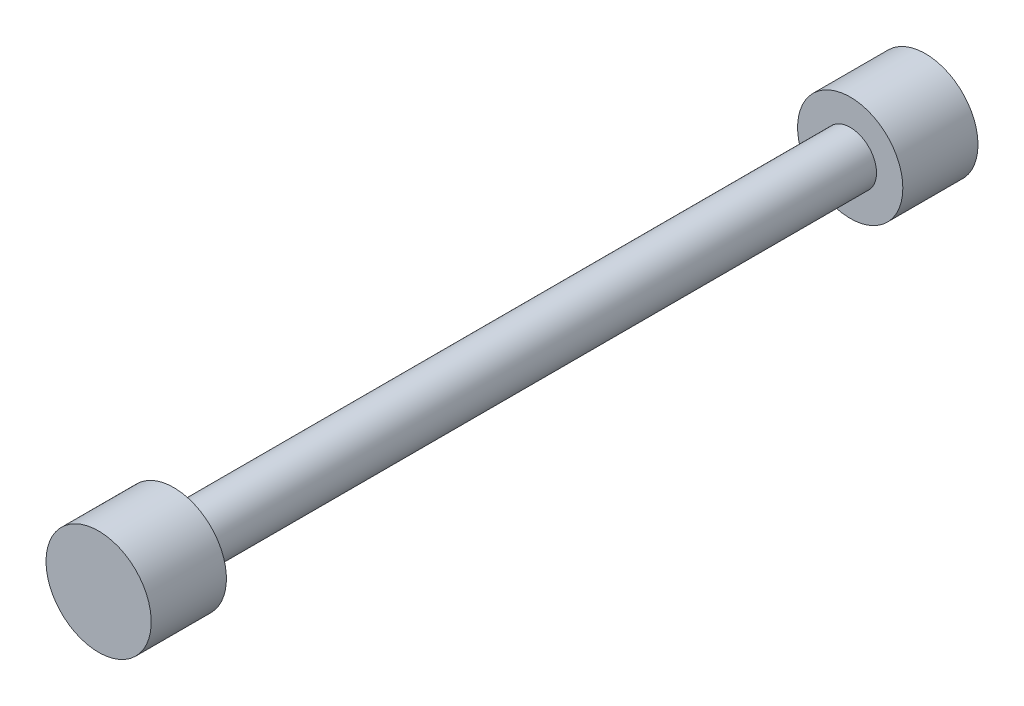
ISO-10303-21;
HEADER;
FILE_DESCRIPTION(('STEP AP214'),'2;1');
FILE_NAME('part.step','',(''),(''),'','','');
FILE_SCHEMA(('AUTOMOTIVE_DESIGN { 1 0 10303 214 1 1 1 1 }'));
ENDSEC;
DATA;
#1=APPLICATION_CONTEXT('core data for automotive mechanical design processes');
#2=APPLICATION_PROTOCOL_DEFINITION('international standard','automotive_design',2000,#1);
#3=PRODUCT_CONTEXT('',#1,'mechanical');
#4=PRODUCT('Part','Part','',(#3));
#5=PRODUCT_RELATED_PRODUCT_CATEGORY('part','',(#4));
#6=PRODUCT_DEFINITION_FORMATION('','',#4);
#7=PRODUCT_DEFINITION_CONTEXT('part definition',#1,'design');
#8=PRODUCT_DEFINITION('design','',#6,#7);
#9=PRODUCT_DEFINITION_SHAPE('','',#8);
#10=(LENGTH_UNIT() NAMED_UNIT(*) SI_UNIT(.MILLI.,.METRE.));
#11=(NAMED_UNIT(*) PLANE_ANGLE_UNIT() SI_UNIT($,.RADIAN.));
#12=(NAMED_UNIT(*) SI_UNIT($,.STERADIAN.) SOLID_ANGLE_UNIT());
#13=UNCERTAINTY_MEASURE_WITH_UNIT(LENGTH_MEASURE(1.E-05),#10,'distance_accuracy_value','');
#14=(GEOMETRIC_REPRESENTATION_CONTEXT(3) GLOBAL_UNCERTAINTY_ASSIGNED_CONTEXT((#13)) GLOBAL_UNIT_ASSIGNED_CONTEXT((#10,
#11,#12)) REPRESENTATION_CONTEXT('',''));
#15=CARTESIAN_POINT('',(0.,0.,0.));
#16=DIRECTION('',(0.,0.,1.));
#17=DIRECTION('',(1.,0.,0.));
#18=AXIS2_PLACEMENT_3D('',#15,#16,#17);
#19=CARTESIAN_POINT('',(0.,0.,100.));
#20=DIRECTION('',(0.,0.,-1.));
#21=DIRECTION('',(-1.,0.,0.));
#22=AXIS2_PLACEMENT_3D('',#19,#20,#21);
#23=CYLINDRICAL_SURFACE('',#22,3.5);
#24=CARTESIAN_POINT('',(0.,0.,5.));
#25=DIRECTION('',(0.,0.,-1.));
#26=DIRECTION('',(-1.,0.,0.));
#27=AXIS2_PLACEMENT_3D('',#24,#25,#26);
#28=CIRCLE('',#27,3.5);
#29=CARTESIAN_POINT('',(-3.49999999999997,0.,5.));
#30=VERTEX_POINT('',#29);
#31=EDGE_CURVE('E36',#30,#30,#28,.T.);
#32=CARTESIAN_POINT('',(0.,0.,95.));
#33=DIRECTION('',(0.,0.,1.));
#34=DIRECTION('',(1.,0.,0.));
#35=AXIS2_PLACEMENT_3D('',#32,#33,#34);
#36=CIRCLE('',#35,3.5);
#37=CARTESIAN_POINT('',(-3.49999999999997,0.,95.));
#38=VERTEX_POINT('',#37);
#39=EDGE_CURVE('E10',#38,#38,#36,.T.);
#40=CARTESIAN_POINT('',(-3.49999999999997,0.,5.));
#41=CARTESIAN_POINT('',(-3.49999999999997,0.,5.9375));
#42=CARTESIAN_POINT('',(-3.49999999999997,0.,6.875));
#43=CARTESIAN_POINT('',(-3.49999999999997,0.,8.75));
#44=CARTESIAN_POINT('',(-3.49999999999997,0.,9.68750000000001));
#45=CARTESIAN_POINT('',(-3.49999999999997,0.,11.5625));
#46=CARTESIAN_POINT('',(-3.49999999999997,0.,12.5));
#47=CARTESIAN_POINT('',(-3.49999999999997,0.,14.375));
#48=CARTESIAN_POINT('',(-3.49999999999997,0.,15.3125));
#49=CARTESIAN_POINT('',(-3.49999999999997,0.,17.1875));
#50=CARTESIAN_POINT('',(-3.49999999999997,0.,18.125));
#51=CARTESIAN_POINT('',(-3.49999999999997,0.,20.));
#52=CARTESIAN_POINT('',(-3.49999999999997,0.,20.9375));
#53=CARTESIAN_POINT('',(-3.49999999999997,0.,22.8125));
#54=CARTESIAN_POINT('',(-3.49999999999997,0.,23.75));
#55=CARTESIAN_POINT('',(-3.49999999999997,0.,25.625));
#56=CARTESIAN_POINT('',(-3.49999999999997,0.,26.5625));
#57=CARTESIAN_POINT('',(-3.49999999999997,0.,28.4375));
#58=CARTESIAN_POINT('',(-3.49999999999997,0.,29.375));
#59=CARTESIAN_POINT('',(-3.49999999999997,0.,31.25));
#60=CARTESIAN_POINT('',(-3.49999999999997,0.,32.1875));
#61=CARTESIAN_POINT('',(-3.49999999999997,0.,34.0625));
#62=CARTESIAN_POINT('',(-3.49999999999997,0.,35.));
#63=CARTESIAN_POINT('',(-3.49999999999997,0.,36.875));
#64=CARTESIAN_POINT('',(-3.49999999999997,0.,37.8125));
#65=CARTESIAN_POINT('',(-3.49999999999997,0.,39.6875));
#66=CARTESIAN_POINT('',(-3.49999999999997,0.,40.625));
#67=CARTESIAN_POINT('',(-3.49999999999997,0.,42.5));
#68=CARTESIAN_POINT('',(-3.49999999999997,0.,43.4375));
#69=CARTESIAN_POINT('',(-3.49999999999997,0.,45.3125));
#70=CARTESIAN_POINT('',(-3.49999999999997,0.,46.25));
#71=CARTESIAN_POINT('',(-3.49999999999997,0.,48.125));
#72=CARTESIAN_POINT('',(-3.49999999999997,0.,49.0625));
#73=CARTESIAN_POINT('',(-3.49999999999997,0.,50.9375));
#74=CARTESIAN_POINT('',(-3.49999999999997,0.,51.875));
#75=CARTESIAN_POINT('',(-3.49999999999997,0.,53.75));
#76=CARTESIAN_POINT('',(-3.49999999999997,0.,54.6875));
#77=CARTESIAN_POINT('',(-3.49999999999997,0.,56.5625));
#78=CARTESIAN_POINT('',(-3.49999999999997,0.,57.5));
#79=CARTESIAN_POINT('',(-3.49999999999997,0.,59.375));
#80=CARTESIAN_POINT('',(-3.49999999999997,0.,60.3125));
#81=CARTESIAN_POINT('',(-3.49999999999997,0.,62.1875));
#82=CARTESIAN_POINT('',(-3.49999999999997,0.,63.125));
#83=CARTESIAN_POINT('',(-3.49999999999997,0.,65.));
#84=CARTESIAN_POINT('',(-3.49999999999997,0.,65.9375));
#85=CARTESIAN_POINT('',(-3.49999999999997,0.,67.8125));
#86=CARTESIAN_POINT('',(-3.49999999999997,0.,68.75));
#87=CARTESIAN_POINT('',(-3.49999999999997,0.,70.625));
#88=CARTESIAN_POINT('',(-3.49999999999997,0.,71.5625));
#89=CARTESIAN_POINT('',(-3.49999999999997,0.,73.4375));
#90=CARTESIAN_POINT('',(-3.49999999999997,0.,74.375));
#91=CARTESIAN_POINT('',(-3.49999999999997,0.,76.25));
#92=CARTESIAN_POINT('',(-3.49999999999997,0.,77.1875));
#93=CARTESIAN_POINT('',(-3.49999999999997,0.,79.0625));
#94=CARTESIAN_POINT('',(-3.49999999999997,0.,80.));
#95=CARTESIAN_POINT('',(-3.49999999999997,0.,81.875));
#96=CARTESIAN_POINT('',(-3.49999999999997,0.,82.8125));
#97=CARTESIAN_POINT('',(-3.49999999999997,0.,84.6875));
#98=CARTESIAN_POINT('',(-3.49999999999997,0.,85.625));
#99=CARTESIAN_POINT('',(-3.49999999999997,0.,87.5));
#100=CARTESIAN_POINT('',(-3.49999999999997,0.,88.4375));
#101=CARTESIAN_POINT('',(-3.49999999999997,0.,90.3125));
#102=CARTESIAN_POINT('',(-3.49999999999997,0.,91.25));
#103=CARTESIAN_POINT('',(-3.49999999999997,0.,93.125));
#104=CARTESIAN_POINT('',(-3.49999999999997,0.,94.0625));
#105=CARTESIAN_POINT('',(-3.49999999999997,0.,95.));
#106=B_SPLINE_CURVE_WITH_KNOTS('',3,(#40,#41,#42,#43,#44,#45,#46,#47,#48,#49,#50,#51,#52,#53,
#54,#55,#56,#57,#58,#59,#60,#61,#62,#63,#64,#65,#66,#67,#68,#69,#70,#71,#72,#73,#74,#75,#76,#77,
#78,#79,#80,#81,#82,#83,#84,#85,#86,#87,#88,#89,#90,#91,#92,#93,#94,#95,#96,#97,#98,#99,#100,
#101,#102,#103,#104,#105),.UNSPECIFIED.,.F.,.F.,(4,2,2,2,2,2,2,2,2,2,2,2,2,2,2,2,2,2,2,2,2,2,2,
2,2,2,2,2,2,2,2,2,4),(0.,2.8125,5.62500000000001,8.4375,11.25,14.0625,16.875,19.6875,22.5,
25.3125,28.125,30.9375,33.75,36.5625,39.375,42.1875,45.,47.8125,50.625,53.4375,56.25,59.0625,
61.875,64.6875,67.5,70.3125,73.125,75.9375,78.75,81.5625,84.375,87.1875,90.),.UNSPECIFIED.);
#107=EDGE_CURVE('BSEAM30',#30,#38,#106,.T.);
#108=ORIENTED_EDGE('',*,*,#31,.F.);
#109=ORIENTED_EDGE('',*,*,#39,.F.);
#110=ORIENTED_EDGE('',*,*,#107,.T.);
#111=ORIENTED_EDGE('',*,*,#107,.F.);
#112=EDGE_LOOP('',(#108,#110,#109,#111));
#113=FACE_BOUND('',#112,.T.);
#114=ADVANCED_FACE('F30',(#113),#23,.T.);
#115=CARTESIAN_POINT('',(0.,0.,5.));
#116=DIRECTION('',(0.,0.,-1.));
#117=DIRECTION('',(-1.,0.,0.));
#118=AXIS2_PLACEMENT_3D('',#115,#116,#117);
#119=PLANE('',#118);
#120=CARTESIAN_POINT('',(0.,0.,5.));
#121=DIRECTION('',(0.,0.,1.));
#122=DIRECTION('',(1.,0.,0.));
#123=AXIS2_PLACEMENT_3D('',#120,#121,#122);
#124=CIRCLE('',#123,7.);
#125=CARTESIAN_POINT('',(7.,0.,5.));
#126=VERTEX_POINT('',#125);
#127=EDGE_CURVE('E40',#126,#126,#124,.T.);
#128=ORIENTED_EDGE('',*,*,#127,.T.);
#129=EDGE_LOOP('',(#128));
#130=FACE_BOUND('',#129,.T.);
#131=ORIENTED_EDGE('',*,*,#31,.T.);
#132=EDGE_LOOP('',(#131));
#133=FACE_BOUND('',#132,.T.);
#134=ADVANCED_FACE('F71',(#130,#133),#119,.F.);
#135=CARTESIAN_POINT('',(0.,0.,10.));
#136=DIRECTION('',(0.,0.,1.));
#137=DIRECTION('',(1.,0.,0.));
#138=AXIS2_PLACEMENT_3D('',#135,#136,#137);
#139=CYLINDRICAL_SURFACE('',#138,7.);
#140=ORIENTED_EDGE('',*,*,#127,.F.);
#141=EDGE_LOOP('',(#140));
#142=FACE_BOUND('',#141,.T.);
#143=CARTESIAN_POINT('',(0.,0.,-5.));
#144=DIRECTION('',(0.,0.,1.));
#145=DIRECTION('',(1.,0.,0.));
#146=AXIS2_PLACEMENT_3D('',#143,#144,#145);
#147=CIRCLE('',#146,7.);
#148=CARTESIAN_POINT('',(7.00000000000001,0.,-5.));
#149=VERTEX_POINT('',#148);
#150=EDGE_CURVE('E44',#149,#149,#147,.T.);
#151=ORIENTED_EDGE('',*,*,#150,.T.);
#152=EDGE_LOOP('',(#151));
#153=FACE_BOUND('',#152,.T.);
#154=ADVANCED_FACE('F76',(#142,#153),#139,.T.);
#155=CARTESIAN_POINT('',(0.,0.,-5.));
#156=DIRECTION('',(0.,0.,1.));
#157=DIRECTION('',(1.,0.,0.));
#158=AXIS2_PLACEMENT_3D('',#155,#156,#157);
#159=PLANE('',#158);
#160=ORIENTED_EDGE('',*,*,#150,.F.);
#161=EDGE_LOOP('',(#160));
#162=FACE_BOUND('',#161,.T.);
#163=ADVANCED_FACE('F83',(#162),#159,.F.);
#164=CARTESIAN_POINT('',(0.,0.,95.));
#165=DIRECTION('',(0.,0.,1.));
#166=DIRECTION('',(1.,0.,0.));
#167=AXIS2_PLACEMENT_3D('',#164,#165,#166);
#168=PLANE('',#167);
#169=CARTESIAN_POINT('',(0.,0.,95.));
#170=DIRECTION('',(0.,0.,-1.));
#171=DIRECTION('',(-1.,0.,0.));
#172=AXIS2_PLACEMENT_3D('',#169,#170,#171);
#173=CIRCLE('',#172,7.);
#174=CARTESIAN_POINT('',(-6.99999999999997,0.,95.));
#175=VERTEX_POINT('',#174);
#176=EDGE_CURVE('E52',#175,#175,#173,.T.);
#177=ORIENTED_EDGE('',*,*,#176,.T.);
#178=EDGE_LOOP('',(#177));
#179=FACE_BOUND('',#178,.T.);
#180=ORIENTED_EDGE('',*,*,#39,.T.);
#181=EDGE_LOOP('',(#180));
#182=FACE_BOUND('',#181,.T.);
#183=ADVANCED_FACE('F56',(#179,#182),#168,.F.);
#184=CARTESIAN_POINT('',(0.,0.,90.));
#185=DIRECTION('',(0.,0.,-1.));
#186=DIRECTION('',(-1.,0.,0.));
#187=AXIS2_PLACEMENT_3D('',#184,#185,#186);
#188=CYLINDRICAL_SURFACE('',#187,7.);
#189=ORIENTED_EDGE('',*,*,#176,.F.);
#190=EDGE_LOOP('',(#189));
#191=FACE_BOUND('',#190,.T.);
#192=CARTESIAN_POINT('',(0.,0.,105.));
#193=DIRECTION('',(0.,0.,-1.));
#194=DIRECTION('',(-1.,0.,0.));
#195=AXIS2_PLACEMENT_3D('',#192,#193,#194);
#196=CIRCLE('',#195,7.);
#197=CARTESIAN_POINT('',(-7.,0.,105.));
#198=VERTEX_POINT('',#197);
#199=EDGE_CURVE('E49',#198,#198,#196,.T.);
#200=ORIENTED_EDGE('',*,*,#199,.T.);
#201=EDGE_LOOP('',(#200));
#202=FACE_BOUND('',#201,.T.);
#203=ADVANCED_FACE('F58',(#191,#202),#188,.T.);
#204=CARTESIAN_POINT('',(7.00000000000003,0.,105.));
#205=DIRECTION('',(0.,0.,-1.));
#206=DIRECTION('',(-1.,0.,0.));
#207=AXIS2_PLACEMENT_3D('',#204,#205,#206);
#208=PLANE('',#207);
#209=ORIENTED_EDGE('',*,*,#199,.F.);
#210=EDGE_LOOP('',(#209));
#211=FACE_BOUND('',#210,.T.);
#212=ADVANCED_FACE('F61',(#211),#208,.F.);
#213=CLOSED_SHELL('',(#114,#134,#154,#163,#183,#203,#212));
#214=MANIFOLD_SOLID_BREP('B2',#213);
#215=ADVANCED_BREP_SHAPE_REPRESENTATION('',(#18,#214),#14);
#216=SHAPE_DEFINITION_REPRESENTATION(#9,#215);
ENDSEC;
END-ISO-10303-21;
